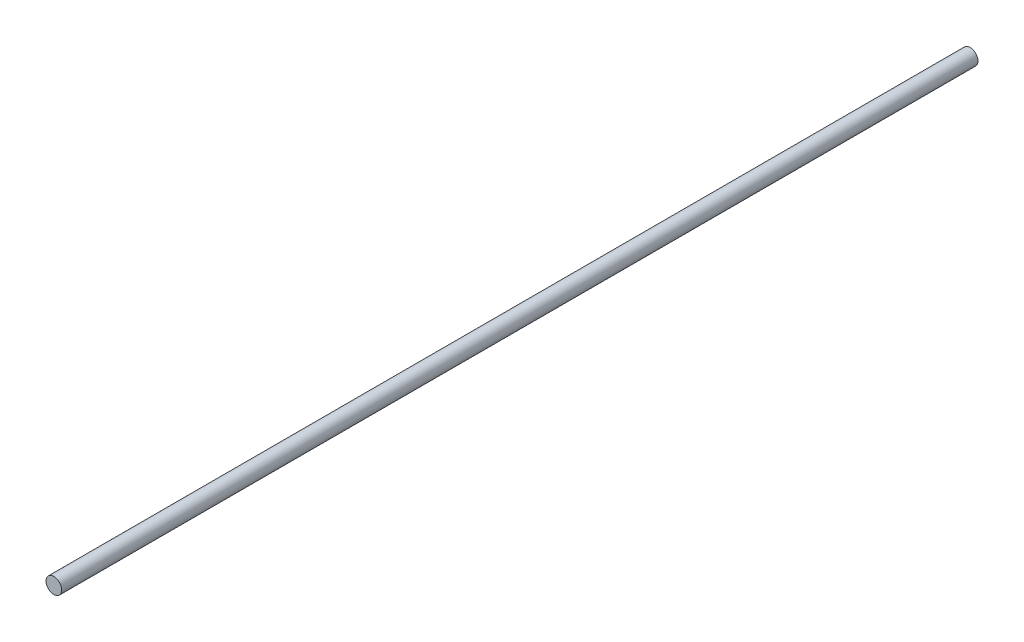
ISO-10303-21;
HEADER;
FILE_DESCRIPTION(('STEP AP214'),'2;1');
FILE_NAME('part.step','',(''),(''),'','','');
FILE_SCHEMA(('AUTOMOTIVE_DESIGN { 1 0 10303 214 1 1 1 1 }'));
ENDSEC;
DATA;
#1=APPLICATION_CONTEXT('core data for automotive mechanical design processes');
#2=APPLICATION_PROTOCOL_DEFINITION('international standard','automotive_design',2000,#1);
#3=PRODUCT_CONTEXT('',#1,'mechanical');
#4=PRODUCT('Part','Part','',(#3));
#5=PRODUCT_RELATED_PRODUCT_CATEGORY('part','',(#4));
#6=PRODUCT_DEFINITION_FORMATION('','',#4);
#7=PRODUCT_DEFINITION_CONTEXT('part definition',#1,'design');
#8=PRODUCT_DEFINITION('design','',#6,#7);
#9=PRODUCT_DEFINITION_SHAPE('','',#8);
#10=(LENGTH_UNIT() NAMED_UNIT(*) SI_UNIT(.MILLI.,.METRE.));
#11=(NAMED_UNIT(*) PLANE_ANGLE_UNIT() SI_UNIT($,.RADIAN.));
#12=(NAMED_UNIT(*) SI_UNIT($,.STERADIAN.) SOLID_ANGLE_UNIT());
#13=UNCERTAINTY_MEASURE_WITH_UNIT(LENGTH_MEASURE(1.E-05),#10,'distance_accuracy_value','');
#14=(GEOMETRIC_REPRESENTATION_CONTEXT(3) GLOBAL_UNCERTAINTY_ASSIGNED_CONTEXT((#13)) GLOBAL_UNIT_ASSIGNED_CONTEXT((#10,
#11,#12)) REPRESENTATION_CONTEXT('',''));
#15=CARTESIAN_POINT('',(0.,0.,0.));
#16=DIRECTION('',(0.,0.,1.));
#17=DIRECTION('',(1.,0.,0.));
#18=AXIS2_PLACEMENT_3D('',#15,#16,#17);
#19=CARTESIAN_POINT('',(0.,0.,-3500.));
#20=DIRECTION('',(0.,0.,1.));
#21=DIRECTION('',(1.,0.,0.));
#22=AXIS2_PLACEMENT_3D('',#19,#20,#21);
#23=CYLINDRICAL_SURFACE('',#22,30.);
#24=CARTESIAN_POINT('',(0.,0.,-3500.));
#25=DIRECTION('',(0.,0.,1.));
#26=DIRECTION('',(1.,0.,0.));
#27=AXIS2_PLACEMENT_3D('',#24,#25,#26);
#28=CIRCLE('',#27,30.);
#29=CARTESIAN_POINT('',(30.,0.,-3500.));
#30=VERTEX_POINT('',#29);
#31=EDGE_CURVE('E10',#30,#30,#28,.T.);
#32=ORIENTED_EDGE('',*,*,#31,.T.);
#33=EDGE_LOOP('',(#32));
#34=FACE_BOUND('',#33,.T.);
#35=CARTESIAN_POINT('',(0.,0.,0.));
#36=DIRECTION('',(0.,0.,1.));
#37=DIRECTION('',(1.,0.,0.));
#38=AXIS2_PLACEMENT_3D('',#35,#36,#37);
#39=CIRCLE('',#38,30.);
#40=CARTESIAN_POINT('',(30.,0.,0.));
#41=VERTEX_POINT('',#40);
#42=EDGE_CURVE('E40',#41,#41,#39,.T.);
#43=ORIENTED_EDGE('',*,*,#42,.F.);
#44=EDGE_LOOP('',(#43));
#45=FACE_BOUND('',#44,.T.);
#46=ADVANCED_FACE('F37',(#34,#45),#23,.T.);
#47=CARTESIAN_POINT('',(0.,0.,-3500.));
#48=DIRECTION('',(0.,0.,1.));
#49=DIRECTION('',(1.,0.,0.));
#50=AXIS2_PLACEMENT_3D('',#47,#48,#49);
#51=PLANE('',#50);
#52=ORIENTED_EDGE('',*,*,#31,.F.);
#53=EDGE_LOOP('',(#52));
#54=FACE_BOUND('',#53,.T.);
#55=ADVANCED_FACE('F54',(#54),#51,.F.);
#56=CARTESIAN_POINT('',(0.,0.,0.));
#57=DIRECTION('',(0.,0.,1.));
#58=DIRECTION('',(1.,0.,0.));
#59=AXIS2_PLACEMENT_3D('',#56,#57,#58);
#60=PLANE('',#59);
#61=ORIENTED_EDGE('',*,*,#42,.T.);
#62=EDGE_LOOP('',(#61));
#63=FACE_BOUND('',#62,.T.);
#64=ADVANCED_FACE('F51',(#63),#60,.T.);
#65=CLOSED_SHELL('',(#46,#55,#64));
#66=MANIFOLD_SOLID_BREP('B2',#65);
#67=ADVANCED_BREP_SHAPE_REPRESENTATION('',(#18,#66),#14);
#68=SHAPE_DEFINITION_REPRESENTATION(#9,#67);
ENDSEC;
END-ISO-10303-21;
